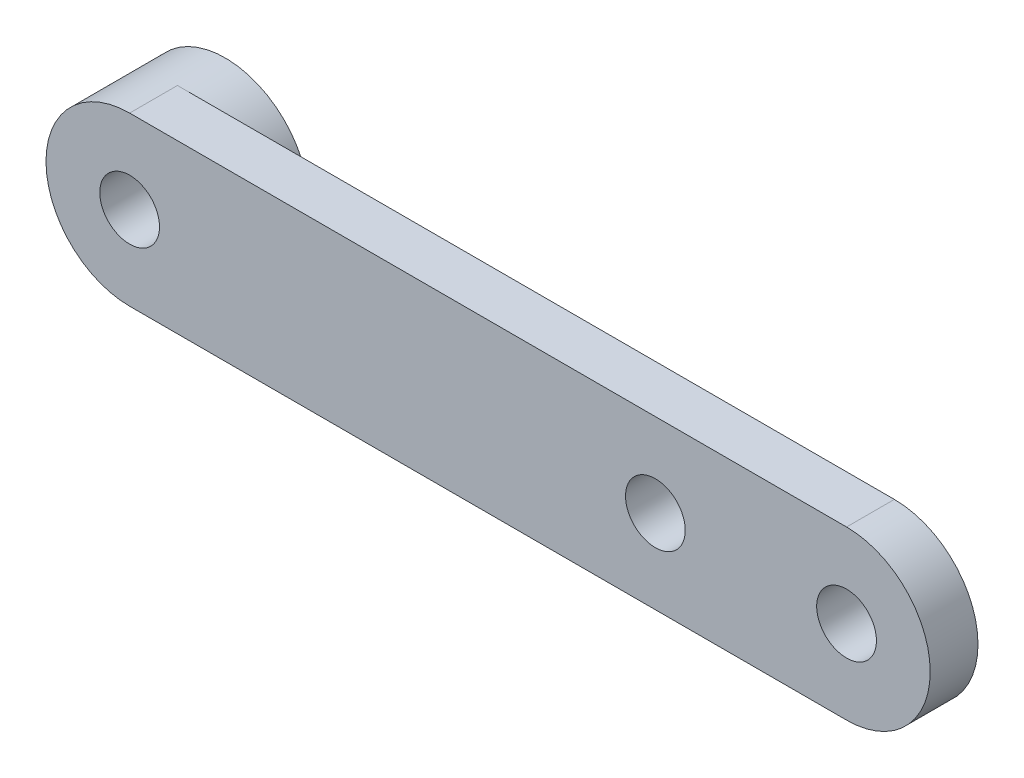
ISO-10303-21;
HEADER;
FILE_DESCRIPTION(('STEP AP214'),'2;1');
FILE_NAME('part.step','',(''),(''),'','','');
FILE_SCHEMA(('AUTOMOTIVE_DESIGN { 1 0 10303 214 1 1 1 1 }'));
ENDSEC;
DATA;
#1=APPLICATION_CONTEXT('core data for automotive mechanical design processes');
#2=APPLICATION_PROTOCOL_DEFINITION('international standard','automotive_design',2000,#1);
#3=PRODUCT_CONTEXT('',#1,'mechanical');
#4=PRODUCT('Part','Part','',(#3));
#5=PRODUCT_RELATED_PRODUCT_CATEGORY('part','',(#4));
#6=PRODUCT_DEFINITION_FORMATION('','',#4);
#7=PRODUCT_DEFINITION_CONTEXT('part definition',#1,'design');
#8=PRODUCT_DEFINITION('design','',#6,#7);
#9=PRODUCT_DEFINITION_SHAPE('','',#8);
#10=(LENGTH_UNIT() NAMED_UNIT(*) SI_UNIT(.MILLI.,.METRE.));
#11=(NAMED_UNIT(*) PLANE_ANGLE_UNIT() SI_UNIT($,.RADIAN.));
#12=(NAMED_UNIT(*) SI_UNIT($,.STERADIAN.) SOLID_ANGLE_UNIT());
#13=UNCERTAINTY_MEASURE_WITH_UNIT(LENGTH_MEASURE(1.E-05),#10,'distance_accuracy_value','');
#14=(GEOMETRIC_REPRESENTATION_CONTEXT(3) GLOBAL_UNCERTAINTY_ASSIGNED_CONTEXT((#13)) GLOBAL_UNIT_ASSIGNED_CONTEXT((#10,
#11,#12)) REPRESENTATION_CONTEXT('',''));
#15=CARTESIAN_POINT('',(0.,0.,0.));
#16=DIRECTION('',(0.,0.,1.));
#17=DIRECTION('',(1.,0.,0.));
#18=AXIS2_PLACEMENT_3D('',#15,#16,#17);
#19=CARTESIAN_POINT('',(-31.75,-3.81000000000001,0.));
#20=DIRECTION('',(0.,0.,1.));
#21=DIRECTION('',(1.,0.,0.));
#22=AXIS2_PLACEMENT_3D('',#19,#20,#21);
#23=PLANE('',#22);
#24=CARTESIAN_POINT('',(-31.75,-3.81000000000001,0.));
#25=DIRECTION('',(0.,0.,1.));
#26=DIRECTION('',(1.,0.,0.));
#27=AXIS2_PLACEMENT_3D('',#24,#25,#26);
#28=CIRCLE('',#27,1.5875);
#29=CARTESIAN_POINT('',(-30.1625,-3.81000000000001,0.));
#30=VERTEX_POINT('',#29);
#31=EDGE_CURVE('E120',#30,#30,#28,.T.);
#32=ORIENTED_EDGE('',*,*,#31,.T.);
#33=EDGE_LOOP('',(#32));
#34=FACE_BOUND('',#33,.T.);
#35=CARTESIAN_POINT('',(-41.91,-3.81,0.));
#36=DIRECTION('',(0.,0.,1.));
#37=DIRECTION('',(1.,0.,0.));
#38=AXIS2_PLACEMENT_3D('',#35,#36,#37);
#39=CIRCLE('',#38,1.5875);
#40=CARTESIAN_POINT('',(-40.3225,-3.81,0.));
#41=VERTEX_POINT('',#40);
#42=EDGE_CURVE('E116',#41,#41,#39,.T.);
#43=ORIENTED_EDGE('',*,*,#42,.T.);
#44=EDGE_LOOP('',(#43));
#45=FACE_BOUND('',#44,.T.);
#46=CARTESIAN_POINT('',(-69.85,-3.81000000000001,0.));
#47=DIRECTION('',(0.,0.,-1.));
#48=DIRECTION('',(-1.,0.,0.));
#49=AXIS2_PLACEMENT_3D('',#46,#47,#48);
#50=CIRCLE('',#49,4.445);
#51=CARTESIAN_POINT('',(-69.85,0.634999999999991,0.));
#52=VERTEX_POINT('',#51);
#53=CARTESIAN_POINT('',(-69.85,-8.25500000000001,0.));
#54=VERTEX_POINT('',#53);
#55=EDGE_CURVE('E65',#52,#54,#50,.T.);
#56=ORIENTED_EDGE('',*,*,#55,.F.);
#57=DIRECTION('',(-1.,0.,0.));
#58=VECTOR('',#57,1.);
#59=CARTESIAN_POINT('',(-31.75,0.634999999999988,0.));
#60=LINE('',#59,#58);
#61=CARTESIAN_POINT('',(-31.75,0.634999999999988,0.));
#62=VERTEX_POINT('',#61);
#63=EDGE_CURVE('E83',#62,#52,#60,.T.);
#64=ORIENTED_EDGE('',*,*,#63,.F.);
#65=CARTESIAN_POINT('',(-31.75,-3.81000000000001,0.));
#66=DIRECTION('',(0.,0.,1.));
#67=DIRECTION('',(1.,0.,0.));
#68=AXIS2_PLACEMENT_3D('',#65,#66,#67);
#69=CIRCLE('',#68,4.445);
#70=CARTESIAN_POINT('',(-31.75,-8.25500000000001,0.));
#71=VERTEX_POINT('',#70);
#72=EDGE_CURVE('E91',#71,#62,#69,.T.);
#73=ORIENTED_EDGE('',*,*,#72,.F.);
#74=DIRECTION('',(1.,0.,0.));
#75=VECTOR('',#74,1.);
#76=CARTESIAN_POINT('',(-31.75,-8.25500000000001,0.));
#77=LINE('',#76,#75);
#78=EDGE_CURVE('E71',#54,#71,#77,.T.);
#79=ORIENTED_EDGE('',*,*,#78,.F.);
#80=EDGE_LOOP('',(#56,#64,#73,#79));
#81=FACE_BOUND('',#80,.T.);
#82=ADVANCED_FACE('F31',(#34,#45,#81),#23,.F.);
#83=CARTESIAN_POINT('',(-31.75,-3.81000000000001,2.54));
#84=DIRECTION('',(0.,0.,1.));
#85=DIRECTION('',(1.,0.,0.));
#86=AXIS2_PLACEMENT_3D('',#83,#84,#85);
#87=PLANE('',#86);
#88=CARTESIAN_POINT('',(-41.91,-3.81,2.54));
#89=DIRECTION('',(0.,0.,1.));
#90=DIRECTION('',(1.,0.,0.));
#91=AXIS2_PLACEMENT_3D('',#88,#89,#90);
#92=CIRCLE('',#91,1.5875);
#93=CARTESIAN_POINT('',(-40.3225,-3.81,2.54));
#94=VERTEX_POINT('',#93);
#95=EDGE_CURVE('E117',#94,#94,#92,.T.);
#96=ORIENTED_EDGE('',*,*,#95,.F.);
#97=EDGE_LOOP('',(#96));
#98=FACE_BOUND('',#97,.T.);
#99=CARTESIAN_POINT('',(-31.75,-3.81000000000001,2.54));
#100=DIRECTION('',(0.,0.,1.));
#101=DIRECTION('',(1.,0.,0.));
#102=AXIS2_PLACEMENT_3D('',#99,#100,#101);
#103=CIRCLE('',#102,4.445);
#104=CARTESIAN_POINT('',(-31.75,-8.25500000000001,2.54));
#105=VERTEX_POINT('',#104);
#106=CARTESIAN_POINT('',(-31.75,0.634999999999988,2.54));
#107=VERTEX_POINT('',#106);
#108=EDGE_CURVE('E105',#105,#107,#103,.T.);
#109=ORIENTED_EDGE('',*,*,#108,.T.);
#110=DIRECTION('',(-1.,0.,0.));
#111=VECTOR('',#110,1.);
#112=CARTESIAN_POINT('',(-31.75,0.634999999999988,2.54));
#113=LINE('',#112,#111);
#114=CARTESIAN_POINT('',(-69.85,0.634999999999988,2.54));
#115=VERTEX_POINT('',#114);
#116=EDGE_CURVE('E78',#107,#115,#113,.T.);
#117=ORIENTED_EDGE('',*,*,#116,.T.);
#118=CARTESIAN_POINT('',(-69.85,-3.81000000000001,2.54));
#119=DIRECTION('',(0.,0.,1.));
#120=DIRECTION('',(1.,0.,0.));
#121=AXIS2_PLACEMENT_3D('',#118,#119,#120);
#122=CIRCLE('',#121,4.445);
#123=CARTESIAN_POINT('',(-69.85,-8.25500000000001,2.54));
#124=VERTEX_POINT('',#123);
#125=EDGE_CURVE('E95',#115,#124,#122,.T.);
#126=ORIENTED_EDGE('',*,*,#125,.T.);
#127=DIRECTION('',(1.,0.,0.));
#128=VECTOR('',#127,1.);
#129=CARTESIAN_POINT('',(-31.75,-8.25500000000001,2.54));
#130=LINE('',#129,#128);
#131=EDGE_CURVE('E50',#124,#105,#130,.T.);
#132=ORIENTED_EDGE('',*,*,#131,.T.);
#133=EDGE_LOOP('',(#109,#117,#126,#132));
#134=FACE_BOUND('',#133,.T.);
#135=CARTESIAN_POINT('',(-31.75,-3.81000000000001,2.54));
#136=DIRECTION('',(0.,0.,1.));
#137=DIRECTION('',(1.,0.,0.));
#138=AXIS2_PLACEMENT_3D('',#135,#136,#137);
#139=CIRCLE('',#138,1.5875);
#140=CARTESIAN_POINT('',(-30.1625,-3.81000000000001,2.54));
#141=VERTEX_POINT('',#140);
#142=EDGE_CURVE('E123',#141,#141,#139,.T.);
#143=ORIENTED_EDGE('',*,*,#142,.F.);
#144=EDGE_LOOP('',(#143));
#145=FACE_BOUND('',#144,.T.);
#146=CARTESIAN_POINT('',(-69.85,-3.81000000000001,2.54));
#147=DIRECTION('',(0.,0.,1.));
#148=DIRECTION('',(1.,0.,0.));
#149=AXIS2_PLACEMENT_3D('',#146,#147,#148);
#150=CIRCLE('',#149,1.5875);
#151=CARTESIAN_POINT('',(-68.2625,-3.81000000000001,2.54));
#152=VERTEX_POINT('',#151);
#153=EDGE_CURVE('E113',#152,#152,#150,.T.);
#154=ORIENTED_EDGE('',*,*,#153,.F.);
#155=EDGE_LOOP('',(#154));
#156=FACE_BOUND('',#155,.T.);
#157=ADVANCED_FACE('F148',(#98,#134,#145,#156),#87,.T.);
#158=CARTESIAN_POINT('',(-31.75,-3.81000000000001,2.54));
#159=DIRECTION('',(0.,0.,-1.));
#160=DIRECTION('',(-1.,0.,0.));
#161=AXIS2_PLACEMENT_3D('',#158,#159,#160);
#162=CYLINDRICAL_SURFACE('',#161,4.445);
#163=ORIENTED_EDGE('',*,*,#72,.T.);
#164=DIRECTION('',(0.,0.,-1.));
#165=VECTOR('',#164,1.);
#166=CARTESIAN_POINT('',(-31.75,0.634999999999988,2.54));
#167=LINE('',#166,#165);
#168=EDGE_CURVE('E11',#107,#62,#167,.T.);
#169=ORIENTED_EDGE('',*,*,#168,.F.);
#170=ORIENTED_EDGE('',*,*,#108,.F.);
#171=DIRECTION('',(0.,0.,-1.));
#172=VECTOR('',#171,1.);
#173=CARTESIAN_POINT('',(-31.75,-8.25500000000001,2.54));
#174=LINE('',#173,#172);
#175=EDGE_CURVE('E97',#105,#71,#174,.T.);
#176=ORIENTED_EDGE('',*,*,#175,.T.);
#177=EDGE_LOOP('',(#163,#169,#170,#176));
#178=FACE_BOUND('',#177,.T.);
#179=ADVANCED_FACE('F33',(#178),#162,.T.);
#180=CARTESIAN_POINT('',(-31.75,0.634999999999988,2.54));
#181=DIRECTION('',(0.,-1.,0.));
#182=DIRECTION('',(0.,0.,-1.));
#183=AXIS2_PLACEMENT_3D('',#180,#181,#182);
#184=PLANE('',#183);
#185=ORIENTED_EDGE('',*,*,#63,.T.);
#186=DIRECTION('',(0.,0.,-1.));
#187=VECTOR('',#186,1.);
#188=CARTESIAN_POINT('',(-69.85,0.634999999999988,2.54));
#189=LINE('',#188,#187);
#190=EDGE_CURVE('E41',#115,#52,#189,.T.);
#191=ORIENTED_EDGE('',*,*,#190,.F.);
#192=ORIENTED_EDGE('',*,*,#116,.F.);
#193=ORIENTED_EDGE('',*,*,#168,.T.);
#194=EDGE_LOOP('',(#185,#191,#192,#193));
#195=FACE_BOUND('',#194,.T.);
#196=ADVANCED_FACE('F87',(#195),#184,.F.);
#197=CARTESIAN_POINT('',(-69.85,-3.81000000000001,2.54));
#198=DIRECTION('',(0.,0.,-1.));
#199=DIRECTION('',(-1.,0.,0.));
#200=AXIS2_PLACEMENT_3D('',#197,#198,#199);
#201=CYLINDRICAL_SURFACE('',#200,4.445);
#202=ORIENTED_EDGE('',*,*,#190,.T.);
#203=ORIENTED_EDGE('',*,*,#55,.T.);
#204=DIRECTION('',(0.,0.,-1.));
#205=VECTOR('',#204,1.);
#206=CARTESIAN_POINT('',(-69.85,-8.25500000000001,2.54));
#207=LINE('',#206,#205);
#208=EDGE_CURVE('E96',#124,#54,#207,.T.);
#209=ORIENTED_EDGE('',*,*,#208,.F.);
#210=ORIENTED_EDGE('',*,*,#125,.F.);
#211=EDGE_LOOP('',(#202,#203,#209,#210));
#212=FACE_BOUND('',#211,.T.);
#213=CARTESIAN_POINT('',(-69.85,-3.81000000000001,-2.54));
#214=DIRECTION('',(0.,0.,-1.));
#215=DIRECTION('',(-1.,0.,0.));
#216=AXIS2_PLACEMENT_3D('',#213,#214,#215);
#217=CIRCLE('',#216,4.445);
#218=CARTESIAN_POINT('',(-74.295,-3.81000000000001,-2.54));
#219=VERTEX_POINT('',#218);
#220=EDGE_CURVE('E84',#219,#219,#217,.T.);
#221=ORIENTED_EDGE('',*,*,#220,.F.);
#222=EDGE_LOOP('',(#221));
#223=FACE_BOUND('',#222,.T.);
#224=ADVANCED_FACE('F93',(#212,#223),#201,.T.);
#225=CARTESIAN_POINT('',(-31.75,-8.25500000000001,2.54));
#226=DIRECTION('',(0.,1.,0.));
#227=DIRECTION('',(0.,0.,1.));
#228=AXIS2_PLACEMENT_3D('',#225,#226,#227);
#229=PLANE('',#228);
#230=ORIENTED_EDGE('',*,*,#78,.T.);
#231=ORIENTED_EDGE('',*,*,#175,.F.);
#232=ORIENTED_EDGE('',*,*,#131,.F.);
#233=ORIENTED_EDGE('',*,*,#208,.T.);
#234=EDGE_LOOP('',(#230,#231,#232,#233));
#235=FACE_BOUND('',#234,.T.);
#236=ADVANCED_FACE('F134',(#235),#229,.F.);
#237=CARTESIAN_POINT('',(-31.75,-3.81000000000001,2.54));
#238=DIRECTION('',(0.,0.,-1.));
#239=DIRECTION('',(-1.,0.,0.));
#240=AXIS2_PLACEMENT_3D('',#237,#238,#239);
#241=CYLINDRICAL_SURFACE('',#240,1.5875);
#242=ORIENTED_EDGE('',*,*,#142,.T.);
#243=EDGE_LOOP('',(#242));
#244=FACE_BOUND('',#243,.T.);
#245=ORIENTED_EDGE('',*,*,#31,.F.);
#246=EDGE_LOOP('',(#245));
#247=FACE_BOUND('',#246,.T.);
#248=ADVANCED_FACE('F136',(#244,#247),#241,.F.);
#249=CARTESIAN_POINT('',(-41.91,-3.81,2.54));
#250=DIRECTION('',(0.,0.,-1.));
#251=DIRECTION('',(-1.,0.,0.));
#252=AXIS2_PLACEMENT_3D('',#249,#250,#251);
#253=CYLINDRICAL_SURFACE('',#252,1.5875);
#254=ORIENTED_EDGE('',*,*,#95,.T.);
#255=EDGE_LOOP('',(#254));
#256=FACE_BOUND('',#255,.T.);
#257=ORIENTED_EDGE('',*,*,#42,.F.);
#258=EDGE_LOOP('',(#257));
#259=FACE_BOUND('',#258,.T.);
#260=ADVANCED_FACE('F142',(#256,#259),#253,.F.);
#261=CARTESIAN_POINT('',(-69.85,-3.81000000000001,2.54));
#262=DIRECTION('',(0.,0.,-1.));
#263=DIRECTION('',(-1.,0.,0.));
#264=AXIS2_PLACEMENT_3D('',#261,#262,#263);
#265=CYLINDRICAL_SURFACE('',#264,1.5875);
#266=ORIENTED_EDGE('',*,*,#153,.T.);
#267=EDGE_LOOP('',(#266));
#268=FACE_BOUND('',#267,.T.);
#269=CARTESIAN_POINT('',(-69.85,-3.81000000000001,-2.54));
#270=DIRECTION('',(0.,0.,-1.));
#271=DIRECTION('',(-1.,0.,0.));
#272=AXIS2_PLACEMENT_3D('',#269,#270,#271);
#273=CIRCLE('',#272,1.58750000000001);
#274=CARTESIAN_POINT('',(-71.4375,-3.81000000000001,-2.54));
#275=VERTEX_POINT('',#274);
#276=EDGE_CURVE('E85',#275,#275,#273,.T.);
#277=ORIENTED_EDGE('',*,*,#276,.T.);
#278=EDGE_LOOP('',(#277));
#279=FACE_BOUND('',#278,.T.);
#280=ADVANCED_FACE('F159',(#268,#279),#265,.F.);
#281=CARTESIAN_POINT('',(-69.85,-3.81000000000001,-2.54));
#282=DIRECTION('',(0.,0.,-1.));
#283=DIRECTION('',(-1.,0.,0.));
#284=AXIS2_PLACEMENT_3D('',#281,#282,#283);
#285=PLANE('',#284);
#286=ORIENTED_EDGE('',*,*,#220,.T.);
#287=EDGE_LOOP('',(#286));
#288=FACE_BOUND('',#287,.T.);
#289=ORIENTED_EDGE('',*,*,#276,.F.);
#290=EDGE_LOOP('',(#289));
#291=FACE_BOUND('',#290,.T.);
#292=ADVANCED_FACE('F163',(#288,#291),#285,.T.);
#293=CLOSED_SHELL('',(#82,#157,#179,#196,#224,#236,#248,#260,#280,#292));
#294=MANIFOLD_SOLID_BREP('B2',#293);
#295=ADVANCED_BREP_SHAPE_REPRESENTATION('',(#18,#294),#14);
#296=SHAPE_DEFINITION_REPRESENTATION(#9,#295);
ENDSEC;
END-ISO-10303-21;
